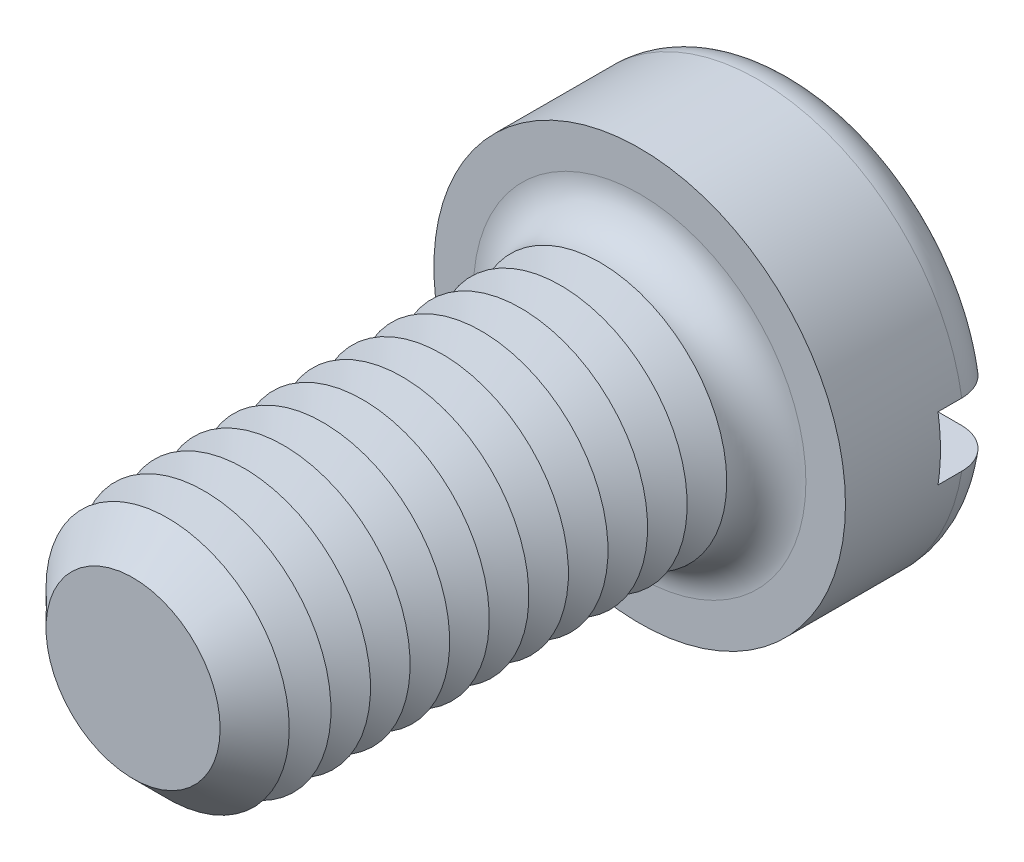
from build123d import *

# Parameters (mm, degrees)
SKETCH3_R           = 6.5
BOSS_EXTRUDE2_DEPTH = 5
SKETCH4_R           = 4
BOSS_EXTRUDE3_DEPTH = 16
FILLET1_R           = 1.25
CHAMFER1_SIZE       = 1.25
LPATTERN1_COUNT     = 11
LPATTERN1_PITCH     = 1.25
SKETCH8_W           = 13
SKETCH8_H           = 2
CUT_EXTRUDE1_DEPTH  = 2


with BuildPart() as part:
    # Sketch3 → Boss-Extrude2 (new body)
    with BuildSketch(Plane.XY):
        Circle(SKETCH3_R)
    extrude(amount=-BOSS_EXTRUDE2_DEPTH)

    # Sketch4 → Boss-Extrude3 (add)
    with BuildSketch(Plane.XY):
        Circle(SKETCH4_R)
    extrude(amount=BOSS_EXTRUDE3_DEPTH)

    # Fillet1
    fillet1_edges = [part.edges().sort_by_distance(p)[0] for p in [
        (-6.5, 0, -5),
        (-4, 0, 0),
    ]]
    fillet(fillet1_edges, radius=FILLET1_R)

    # Chamfer1
    chamfer1_edges = [part.edges().sort_by_distance(p)[0] for p in [
        (-4, 0, 16),
    ]]
    chamfer(chamfer1_edges, length=CHAMFER1_SIZE)

    # Sketch6 → Cut-Revolve1 (revolve, cut)
    with BuildSketch(Plane(origin=(0, 0, 0), x_dir=(0, 0, -1), z_dir=(1, 0, 0)), mode=Mode.PRIVATE) as cut_revolve1_sk:
        Polygon((-1.25, 4), (-1.875, 2.917468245), (-2.5, 4), align=None)
    cut_revolve1 = revolve(cut_revolve1_sk.sketch.rotate(Axis((0, 0, -1.694361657), (0, 0, 1)), 90), axis=Axis((0, 0, -1.694361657), (0, 0, 1)), mode=Mode.SUBTRACT)

    # LPattern1: Cut-Revolve1 ×11
    with Locations(*[(0, 0, i * LPATTERN1_PITCH) for i in range(1, LPATTERN1_COUNT)]):
        add(cut_revolve1, mode=Mode.SUBTRACT)

    # Sketch8 → Cut-Extrude1 (cut)
    with BuildSketch(Plane(origin=(0, 0, -5), x_dir=(-1, 0, 0), z_dir=(0, 0, -1))):
        Rectangle(SKETCH8_W, SKETCH8_H)
    extrude(amount=-CUT_EXTRUDE1_DEPTH, mode=Mode.SUBTRACT)


solid = part.part
